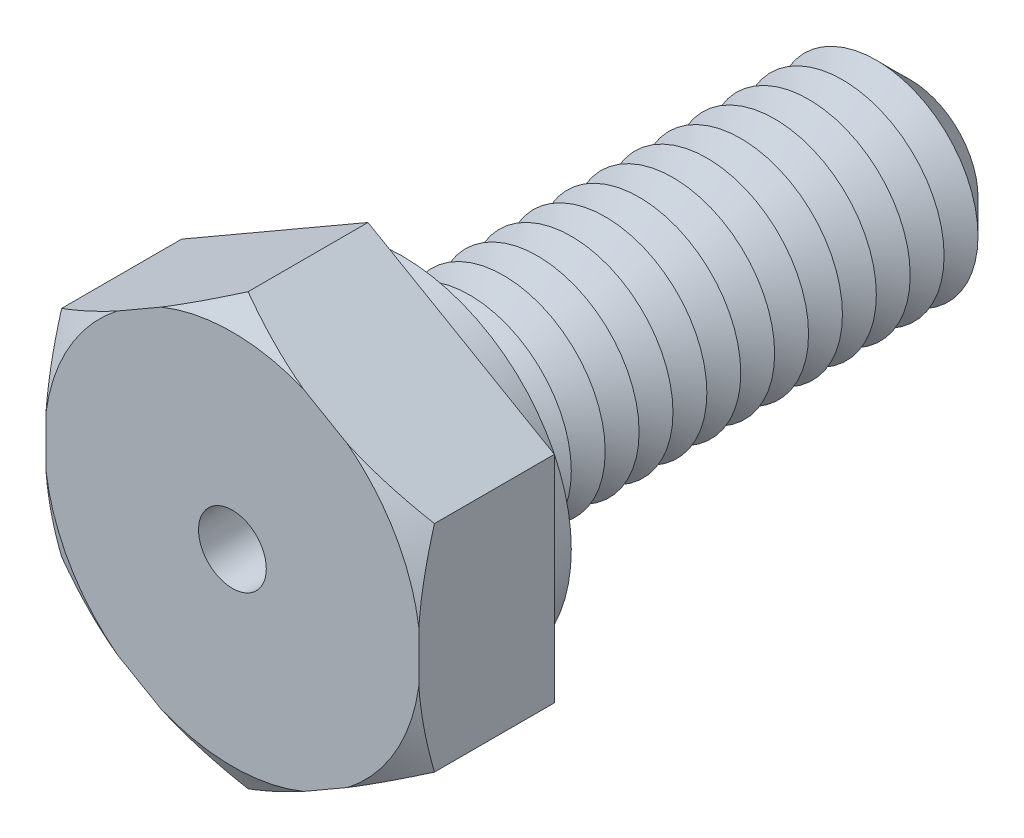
from build123d import *

# Parameters (mm, degrees)
BOSS_EXTRUDE1_DEPTH = 2
SKETCH3_R           = 1.5
BOSS_EXTRUDE2_DEPTH = 8
SKETCH4_R           = 2.5
BOSS_EXTRUDE3_DEPTH = 0.5
CHAMFER1_SIZE       = 0.5
LPATTERN1_COUNT     = 14
LPATTERN1_PITCH     = 0.5
SKETCH8_R           = 0.5
CUT_EXTRUDE1_DEPTH  = 10


with BuildPart() as part:
    # Sketch2 → Boss-Extrude1 (new body)
    with BuildSketch(Plane.XY):
        Polygon((0, 3.175426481), (-2.75, 1.58771324), (-2.75, -1.58771324), (0, -3.175426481), (2.75, -1.58771324), (2.75, 1.58771324), align=None)
    extrude(amount=BOSS_EXTRUDE1_DEPTH)

    # Sketch3 → Boss-Extrude2 (add)
    with BuildSketch(Plane(origin=(0, 0, 0), x_dir=(-1, 0, 0), z_dir=(0, 0, -1))):
        Circle(SKETCH3_R)
    extrude(amount=BOSS_EXTRUDE2_DEPTH)

    # Sketch4 → Boss-Extrude3 (add)
    with BuildSketch(Plane(origin=(0, 0, 0), x_dir=(-1, 0, 0), z_dir=(0, 0, -1))):
        with Locations(Location((0, 0, 0), (0, 0, 180))):
            Circle(SKETCH4_R)
    extrude(amount=BOSS_EXTRUDE3_DEPTH)

    # Chamfer1
    chamfer1_edges = [part.edges().sort_by_distance(p)[0] for p in [
        (1.5, 0, -8),
    ]]
    chamfer(chamfer1_edges, length=CHAMFER1_SIZE)

    # Sketch6 → Cut-Revolve1 (revolve, cut)
    with BuildSketch(Plane(origin=(0, 0, 0), x_dir=(0, 0, -1), z_dir=(1, 0, 0)), mode=Mode.PRIVATE) as cut_revolve1_sk:
        Polygon((0.5, 1.5), (0.75, 1.066987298), (1, 1.5), align=None)
    cut_revolve1 = revolve(cut_revolve1_sk.sketch.rotate(Axis((0, 0, 3.211670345), (0, 0, -1)), 90), axis=Axis((0, 0, 3.211670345), (0, 0, -1)), mode=Mode.SUBTRACT)

    # LPattern1: Cut-Revolve1 ×14
    with Locations(*[(0, 0, -i * LPATTERN1_PITCH) for i in range(1, LPATTERN1_COUNT)]):
        add(cut_revolve1, mode=Mode.SUBTRACT)

    # Sketch7 → Cut-Revolve2 (revolve, cut)
    with BuildSketch(Plane(origin=(0, 0, 0), x_dir=(0, 0, -1), z_dir=(1, 0, 0)), mode=Mode.PRIVATE) as cut_revolve2_sk:
        Polygon((-2, 3.175426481), (-2, 2.775426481), (-1.769059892, 3.175426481), align=None)
    revolve(cut_revolve2_sk.sketch.rotate(Axis((0, 0, 3.211670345), (0, 0, -1)), 90), axis=Axis((0, 0, 3.211670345), (0, 0, -1)), mode=Mode.SUBTRACT)

    # Sketch8 → Cut-Extrude1 (cut)
    with BuildSketch(Plane.XY.offset(2)):
        Circle(SKETCH8_R)
    extrude(amount=-CUT_EXTRUDE1_DEPTH, mode=Mode.SUBTRACT)


solid = part.part
